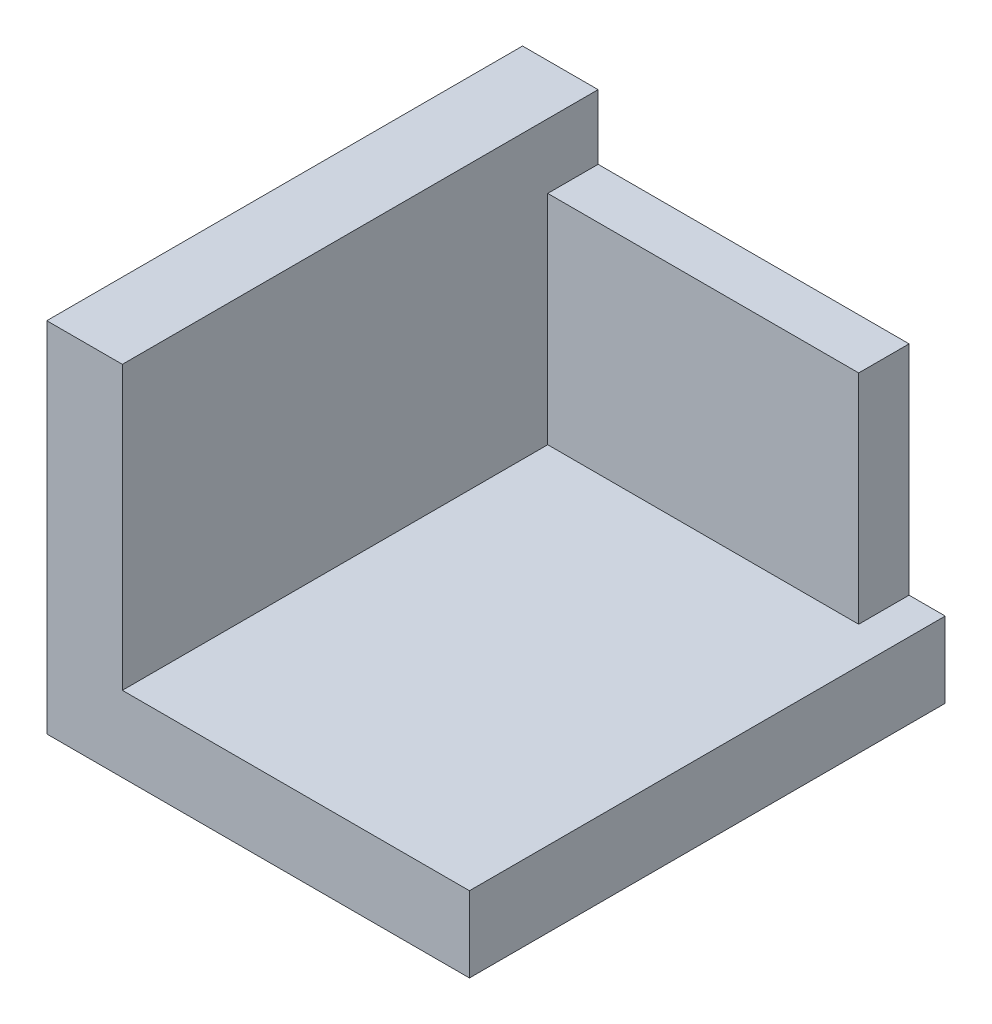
ISO-10303-21;
HEADER;
FILE_DESCRIPTION(('STEP AP214'),'2;1');
FILE_NAME('part.step','',(''),(''),'','','');
FILE_SCHEMA(('AUTOMOTIVE_DESIGN { 1 0 10303 214 1 1 1 1 }'));
ENDSEC;
DATA;
#1=APPLICATION_CONTEXT('core data for automotive mechanical design processes');
#2=APPLICATION_PROTOCOL_DEFINITION('international standard','automotive_design',2000,#1);
#3=PRODUCT_CONTEXT('',#1,'mechanical');
#4=PRODUCT('Part','Part','',(#3));
#5=PRODUCT_RELATED_PRODUCT_CATEGORY('part','',(#4));
#6=PRODUCT_DEFINITION_FORMATION('','',#4);
#7=PRODUCT_DEFINITION_CONTEXT('part definition',#1,'design');
#8=PRODUCT_DEFINITION('design','',#6,#7);
#9=PRODUCT_DEFINITION_SHAPE('','',#8);
#10=(LENGTH_UNIT() NAMED_UNIT(*) SI_UNIT(.MILLI.,.METRE.));
#11=(NAMED_UNIT(*) PLANE_ANGLE_UNIT() SI_UNIT($,.RADIAN.));
#12=(NAMED_UNIT(*) SI_UNIT($,.STERADIAN.) SOLID_ANGLE_UNIT());
#13=UNCERTAINTY_MEASURE_WITH_UNIT(LENGTH_MEASURE(1.E-05),#10,'distance_accuracy_value','');
#14=(GEOMETRIC_REPRESENTATION_CONTEXT(3) GLOBAL_UNCERTAINTY_ASSIGNED_CONTEXT((#13)) GLOBAL_UNIT_ASSIGNED_CONTEXT((#10,
#11,#12)) REPRESENTATION_CONTEXT('',''));
#15=CARTESIAN_POINT('',(0.,0.,0.));
#16=DIRECTION('',(0.,0.,1.));
#17=DIRECTION('',(1.,0.,0.));
#18=AXIS2_PLACEMENT_3D('',#15,#16,#17);
#19=CARTESIAN_POINT('',(0.,15.,0.));
#20=DIRECTION('',(0.,0.,-1.));
#21=DIRECTION('',(-1.,0.,0.));
#22=AXIS2_PLACEMENT_3D('',#19,#20,#21);
#23=PLANE('',#22);
#24=DIRECTION('',(1.,0.,0.));
#25=VECTOR('',#24,1.);
#26=CARTESIAN_POINT('',(0.,0.,0.));
#27=LINE('',#26,#25);
#28=CARTESIAN_POINT('',(-15.,0.,0.));
#29=VERTEX_POINT('',#28);
#30=CARTESIAN_POINT('',(68.8876170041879,0.,0.));
#31=VERTEX_POINT('',#30);
#32=EDGE_CURVE('E72',#29,#31,#27,.T.);
#33=ORIENTED_EDGE('',*,*,#32,.T.);
#34=DIRECTION('',(0.,-1.,0.));
#35=VECTOR('',#34,1.);
#36=CARTESIAN_POINT('',(68.8876170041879,15.,0.));
#37=LINE('',#36,#35);
#38=CARTESIAN_POINT('',(68.8876170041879,15.,0.));
#39=VERTEX_POINT('',#38);
#40=EDGE_CURVE('E11',#39,#31,#37,.T.);
#41=ORIENTED_EDGE('',*,*,#40,.F.);
#42=DIRECTION('',(1.,0.,0.));
#43=VECTOR('',#42,1.);
#44=CARTESIAN_POINT('',(0.,15.,0.));
#45=LINE('',#44,#43);
#46=CARTESIAN_POINT('',(0.,15.,0.));
#47=VERTEX_POINT('',#46);
#48=EDGE_CURVE('E99',#47,#39,#45,.T.);
#49=ORIENTED_EDGE('',*,*,#48,.F.);
#50=DIRECTION('',(0.,1.,0.));
#51=VECTOR('',#50,1.);
#52=CARTESIAN_POINT('',(0.,0.,0.));
#53=LINE('',#52,#51);
#54=CARTESIAN_POINT('',(0.,71.033019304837,0.));
#55=VERTEX_POINT('',#54);
#56=EDGE_CURVE('E109',#47,#55,#53,.T.);
#57=ORIENTED_EDGE('',*,*,#56,.T.);
#58=DIRECTION('',(1.,0.,0.));
#59=VECTOR('',#58,1.);
#60=CARTESIAN_POINT('',(-15.,71.033019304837,0.));
#61=LINE('',#60,#59);
#62=CARTESIAN_POINT('',(-15.,71.033019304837,0.));
#63=VERTEX_POINT('',#62);
#64=EDGE_CURVE('E130',#63,#55,#61,.T.);
#65=ORIENTED_EDGE('',*,*,#64,.F.);
#66=DIRECTION('',(0.,1.,0.));
#67=VECTOR('',#66,1.);
#68=CARTESIAN_POINT('',(-15.,0.,0.));
#69=LINE('',#68,#67);
#70=EDGE_CURVE('E165',#29,#63,#69,.T.);
#71=ORIENTED_EDGE('',*,*,#70,.F.);
#72=EDGE_LOOP('',(#33,#41,#49,#57,#65,#71));
#73=FACE_BOUND('',#72,.T.);
#74=ADVANCED_FACE('F43',(#73),#23,.F.);
#75=CARTESIAN_POINT('',(68.8876170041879,15.,0.));
#76=DIRECTION('',(-1.,0.,0.));
#77=DIRECTION('',(0.,0.,1.));
#78=AXIS2_PLACEMENT_3D('',#75,#76,#77);
#79=PLANE('',#78);
#80=DIRECTION('',(0.,0.,-1.));
#81=VECTOR('',#80,1.);
#82=CARTESIAN_POINT('',(68.8876170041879,0.,0.));
#83=LINE('',#82,#81);
#84=CARTESIAN_POINT('',(68.8876170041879,0.,-94.4235461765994));
#85=VERTEX_POINT('',#84);
#86=EDGE_CURVE('E129',#31,#85,#83,.T.);
#87=ORIENTED_EDGE('',*,*,#86,.T.);
#88=DIRECTION('',(0.,-1.,0.));
#89=VECTOR('',#88,1.);
#90=CARTESIAN_POINT('',(68.8876170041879,15.,-94.4235461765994));
#91=LINE('',#90,#89);
#92=CARTESIAN_POINT('',(68.8876170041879,15.,-94.4235461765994));
#93=VERTEX_POINT('',#92);
#94=EDGE_CURVE('E52',#93,#85,#91,.T.);
#95=ORIENTED_EDGE('',*,*,#94,.F.);
#96=DIRECTION('',(0.,0.,-1.));
#97=VECTOR('',#96,1.);
#98=CARTESIAN_POINT('',(68.8876170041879,15.,0.));
#99=LINE('',#98,#97);
#100=EDGE_CURVE('E60',#39,#93,#99,.T.);
#101=ORIENTED_EDGE('',*,*,#100,.F.);
#102=ORIENTED_EDGE('',*,*,#40,.T.);
#103=EDGE_LOOP('',(#87,#95,#101,#102));
#104=FACE_BOUND('',#103,.T.);
#105=ADVANCED_FACE('F244',(#104),#79,.F.);
#106=CARTESIAN_POINT('',(0.,15.,-94.4235461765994));
#107=DIRECTION('',(0.,0.,1.));
#108=DIRECTION('',(1.,0.,0.));
#109=AXIS2_PLACEMENT_3D('',#106,#107,#108);
#110=PLANE('',#109);
#111=DIRECTION('',(-1.,0.,0.));
#112=VECTOR('',#111,1.);
#113=CARTESIAN_POINT('',(0.,0.,-94.4235461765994));
#114=LINE('',#113,#112);
#115=CARTESIAN_POINT('',(-15.,0.,-94.4235461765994));
#116=VERTEX_POINT('',#115);
#117=EDGE_CURVE('E106',#85,#116,#114,.T.);
#118=ORIENTED_EDGE('',*,*,#117,.T.);
#119=DIRECTION('',(0.,-1.,0.));
#120=VECTOR('',#119,1.);
#121=CARTESIAN_POINT('',(-15.,0.,-94.4235461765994));
#122=LINE('',#121,#120);
#123=CARTESIAN_POINT('',(-15.,71.033019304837,-94.4235461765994));
#124=VERTEX_POINT('',#123);
#125=EDGE_CURVE('E150',#124,#116,#122,.T.);
#126=ORIENTED_EDGE('',*,*,#125,.F.);
#127=DIRECTION('',(1.,0.,0.));
#128=VECTOR('',#127,1.);
#129=CARTESIAN_POINT('',(-15.,71.033019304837,-94.4235461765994));
#130=LINE('',#129,#128);
#131=CARTESIAN_POINT('',(0.,71.033019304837,-94.4235461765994));
#132=VERTEX_POINT('',#131);
#133=EDGE_CURVE('E149',#124,#132,#130,.T.);
#134=ORIENTED_EDGE('',*,*,#133,.T.);
#135=DIRECTION('',(0.,-1.,0.));
#136=VECTOR('',#135,1.);
#137=CARTESIAN_POINT('',(0.,0.,-94.4235461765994));
#138=LINE('',#137,#136);
#139=CARTESIAN_POINT('',(0.,58.1989684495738,-94.4235461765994));
#140=VERTEX_POINT('',#139);
#141=EDGE_CURVE('E162',#132,#140,#138,.T.);
#142=ORIENTED_EDGE('',*,*,#141,.T.);
#143=DIRECTION('',(1.,0.,0.));
#144=VECTOR('',#143,1.);
#145=CARTESIAN_POINT('',(0.,58.1989684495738,-94.4235461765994));
#146=LINE('',#145,#144);
#147=CARTESIAN_POINT('',(61.7153018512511,58.1989684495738,-94.4235461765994));
#148=VERTEX_POINT('',#147);
#149=EDGE_CURVE('E201',#140,#148,#146,.T.);
#150=ORIENTED_EDGE('',*,*,#149,.T.);
#151=DIRECTION('',(0.,-1.,0.));
#152=VECTOR('',#151,1.);
#153=CARTESIAN_POINT('',(61.7153018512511,15.,-94.4235461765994));
#154=LINE('',#153,#152);
#155=CARTESIAN_POINT('',(61.7153018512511,15.,-94.4235461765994));
#156=VERTEX_POINT('',#155);
#157=EDGE_CURVE('E213',#148,#156,#154,.T.);
#158=ORIENTED_EDGE('',*,*,#157,.T.);
#159=DIRECTION('',(-1.,0.,0.));
#160=VECTOR('',#159,1.);
#161=CARTESIAN_POINT('',(0.,15.,-94.4235461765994));
#162=LINE('',#161,#160);
#163=EDGE_CURVE('E121',#93,#156,#162,.T.);
#164=ORIENTED_EDGE('',*,*,#163,.F.);
#165=ORIENTED_EDGE('',*,*,#94,.T.);
#166=EDGE_LOOP('',(#118,#126,#134,#142,#150,#158,#164,#165));
#167=FACE_BOUND('',#166,.T.);
#168=ADVANCED_FACE('F139',(#167),#110,.F.);
#169=CARTESIAN_POINT('',(0.,15.,0.));
#170=DIRECTION('',(0.,-1.,0.));
#171=DIRECTION('',(0.,0.,-1.));
#172=AXIS2_PLACEMENT_3D('',#169,#170,#171);
#173=PLANE('',#172);
#174=ORIENTED_EDGE('',*,*,#163,.T.);
#175=DIRECTION('',(0.,0.,-1.));
#176=VECTOR('',#175,1.);
#177=CARTESIAN_POINT('',(61.7153018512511,15.,-84.4235461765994));
#178=LINE('',#177,#176);
#179=CARTESIAN_POINT('',(61.7153018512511,15.,-84.4235461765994));
#180=VERTEX_POINT('',#179);
#181=EDGE_CURVE('E116',#180,#156,#178,.T.);
#182=ORIENTED_EDGE('',*,*,#181,.F.);
#183=DIRECTION('',(-1.,0.,0.));
#184=VECTOR('',#183,1.);
#185=CARTESIAN_POINT('',(0.,15.,-84.4235461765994));
#186=LINE('',#185,#184);
#187=CARTESIAN_POINT('',(0.,15.,-84.4235461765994));
#188=VERTEX_POINT('',#187);
#189=EDGE_CURVE('E102',#180,#188,#186,.T.);
#190=ORIENTED_EDGE('',*,*,#189,.T.);
#191=DIRECTION('',(0.,0.,1.));
#192=VECTOR('',#191,1.);
#193=CARTESIAN_POINT('',(0.,15.,0.));
#194=LINE('',#193,#192);
#195=EDGE_CURVE('E95',#188,#47,#194,.T.);
#196=ORIENTED_EDGE('',*,*,#195,.T.);
#197=ORIENTED_EDGE('',*,*,#48,.T.);
#198=ORIENTED_EDGE('',*,*,#100,.T.);
#199=EDGE_LOOP('',(#174,#182,#190,#196,#197,#198));
#200=FACE_BOUND('',#199,.T.);
#201=ADVANCED_FACE('F97',(#200),#173,.F.);
#202=CARTESIAN_POINT('',(0.,0.,0.));
#203=DIRECTION('',(0.,-1.,0.));
#204=DIRECTION('',(0.,0.,-1.));
#205=AXIS2_PLACEMENT_3D('',#202,#203,#204);
#206=PLANE('',#205);
#207=ORIENTED_EDGE('',*,*,#32,.F.);
#208=DIRECTION('',(0.,0.,1.));
#209=VECTOR('',#208,1.);
#210=CARTESIAN_POINT('',(-15.,0.,0.));
#211=LINE('',#210,#209);
#212=EDGE_CURVE('E145',#116,#29,#211,.T.);
#213=ORIENTED_EDGE('',*,*,#212,.F.);
#214=ORIENTED_EDGE('',*,*,#117,.F.);
#215=ORIENTED_EDGE('',*,*,#86,.F.);
#216=EDGE_LOOP('',(#207,#213,#214,#215));
#217=FACE_BOUND('',#216,.T.);
#218=ADVANCED_FACE('F144',(#217),#206,.T.);
#219=CARTESIAN_POINT('',(-15.,71.033019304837,0.));
#220=DIRECTION('',(0.,-1.,0.));
#221=DIRECTION('',(0.,0.,-1.));
#222=AXIS2_PLACEMENT_3D('',#219,#220,#221);
#223=PLANE('',#222);
#224=DIRECTION('',(0.,0.,-1.));
#225=VECTOR('',#224,1.);
#226=CARTESIAN_POINT('',(0.,71.033019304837,0.));
#227=LINE('',#226,#225);
#228=EDGE_CURVE('E112',#55,#132,#227,.T.);
#229=ORIENTED_EDGE('',*,*,#228,.T.);
#230=ORIENTED_EDGE('',*,*,#133,.F.);
#231=DIRECTION('',(0.,0.,-1.));
#232=VECTOR('',#231,1.);
#233=CARTESIAN_POINT('',(-15.,71.033019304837,0.));
#234=LINE('',#233,#232);
#235=EDGE_CURVE('E156',#63,#124,#234,.T.);
#236=ORIENTED_EDGE('',*,*,#235,.F.);
#237=ORIENTED_EDGE('',*,*,#64,.T.);
#238=EDGE_LOOP('',(#229,#230,#236,#237));
#239=FACE_BOUND('',#238,.T.);
#240=ADVANCED_FACE('F169',(#239),#223,.F.);
#241=CARTESIAN_POINT('',(-15.,0.,0.));
#242=DIRECTION('',(-1.,0.,0.));
#243=DIRECTION('',(0.,0.,1.));
#244=AXIS2_PLACEMENT_3D('',#241,#242,#243);
#245=PLANE('',#244);
#246=ORIENTED_EDGE('',*,*,#70,.T.);
#247=ORIENTED_EDGE('',*,*,#235,.T.);
#248=ORIENTED_EDGE('',*,*,#125,.T.);
#249=ORIENTED_EDGE('',*,*,#212,.T.);
#250=EDGE_LOOP('',(#246,#247,#248,#249));
#251=FACE_BOUND('',#250,.T.);
#252=ADVANCED_FACE('F230',(#251),#245,.T.);
#253=CARTESIAN_POINT('',(0.,0.,0.));
#254=DIRECTION('',(-1.,0.,0.));
#255=DIRECTION('',(0.,0.,1.));
#256=AXIS2_PLACEMENT_3D('',#253,#254,#255);
#257=PLANE('',#256);
#258=DIRECTION('',(0.,1.,0.));
#259=VECTOR('',#258,1.);
#260=CARTESIAN_POINT('',(0.,15.,-84.4235461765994));
#261=LINE('',#260,#259);
#262=CARTESIAN_POINT('',(0.,58.1989684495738,-84.4235461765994));
#263=VERTEX_POINT('',#262);
#264=EDGE_CURVE('E208',#188,#263,#261,.T.);
#265=ORIENTED_EDGE('',*,*,#264,.T.);
#266=DIRECTION('',(0.,0.,-1.));
#267=VECTOR('',#266,1.);
#268=CARTESIAN_POINT('',(0.,58.1989684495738,-84.4235461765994));
#269=LINE('',#268,#267);
#270=EDGE_CURVE('E196',#263,#140,#269,.T.);
#271=ORIENTED_EDGE('',*,*,#270,.T.);
#272=ORIENTED_EDGE('',*,*,#141,.F.);
#273=ORIENTED_EDGE('',*,*,#228,.F.);
#274=ORIENTED_EDGE('',*,*,#56,.F.);
#275=ORIENTED_EDGE('',*,*,#195,.F.);
#276=EDGE_LOOP('',(#265,#271,#272,#273,#274,#275));
#277=FACE_BOUND('',#276,.T.);
#278=ADVANCED_FACE('F110',(#277),#257,.F.);
#279=CARTESIAN_POINT('',(61.7153018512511,15.,-84.4235461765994));
#280=DIRECTION('',(1.,0.,0.));
#281=DIRECTION('',(0.,0.,-1.));
#282=AXIS2_PLACEMENT_3D('',#279,#280,#281);
#283=PLANE('',#282);
#284=ORIENTED_EDGE('',*,*,#157,.F.);
#285=DIRECTION('',(0.,0.,-1.));
#286=VECTOR('',#285,1.);
#287=CARTESIAN_POINT('',(61.7153018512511,58.1989684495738,-84.4235461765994));
#288=LINE('',#287,#286);
#289=CARTESIAN_POINT('',(61.7153018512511,58.1989684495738,-84.4235461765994));
#290=VERTEX_POINT('',#289);
#291=EDGE_CURVE('E203',#290,#148,#288,.T.);
#292=ORIENTED_EDGE('',*,*,#291,.F.);
#293=DIRECTION('',(0.,-1.,0.));
#294=VECTOR('',#293,1.);
#295=CARTESIAN_POINT('',(61.7153018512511,15.,-84.4235461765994));
#296=LINE('',#295,#294);
#297=EDGE_CURVE('E209',#290,#180,#296,.T.);
#298=ORIENTED_EDGE('',*,*,#297,.T.);
#299=ORIENTED_EDGE('',*,*,#181,.T.);
#300=EDGE_LOOP('',(#284,#292,#298,#299));
#301=FACE_BOUND('',#300,.T.);
#302=ADVANCED_FACE('F233',(#301),#283,.T.);
#303=CARTESIAN_POINT('',(0.,58.1989684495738,-84.4235461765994));
#304=DIRECTION('',(0.,1.,0.));
#305=DIRECTION('',(0.,0.,1.));
#306=AXIS2_PLACEMENT_3D('',#303,#304,#305);
#307=PLANE('',#306);
#308=ORIENTED_EDGE('',*,*,#149,.F.);
#309=ORIENTED_EDGE('',*,*,#270,.F.);
#310=DIRECTION('',(1.,0.,0.));
#311=VECTOR('',#310,1.);
#312=CARTESIAN_POINT('',(0.,58.1989684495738,-84.4235461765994));
#313=LINE('',#312,#311);
#314=EDGE_CURVE('E199',#263,#290,#313,.T.);
#315=ORIENTED_EDGE('',*,*,#314,.T.);
#316=ORIENTED_EDGE('',*,*,#291,.T.);
#317=EDGE_LOOP('',(#308,#309,#315,#316));
#318=FACE_BOUND('',#317,.T.);
#319=ADVANCED_FACE('F198',(#318),#307,.T.);
#320=CARTESIAN_POINT('',(0.,0.,-84.4235461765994));
#321=DIRECTION('',(0.,0.,-1.));
#322=DIRECTION('',(-1.,0.,0.));
#323=AXIS2_PLACEMENT_3D('',#320,#321,#322);
#324=PLANE('',#323);
#325=ORIENTED_EDGE('',*,*,#264,.F.);
#326=ORIENTED_EDGE('',*,*,#189,.F.);
#327=ORIENTED_EDGE('',*,*,#297,.F.);
#328=ORIENTED_EDGE('',*,*,#314,.F.);
#329=EDGE_LOOP('',(#325,#326,#327,#328));
#330=FACE_BOUND('',#329,.T.);
#331=ADVANCED_FACE('F207',(#330),#324,.F.);
#332=CLOSED_SHELL('',(#74,#105,#168,#201,#218,#240,#252,#278,#302,#319,#331));
#333=MANIFOLD_SOLID_BREP('B2',#332);
#334=ADVANCED_BREP_SHAPE_REPRESENTATION('',(#18,#333),#14);
#335=SHAPE_DEFINITION_REPRESENTATION(#9,#334);
ENDSEC;
END-ISO-10303-21;
